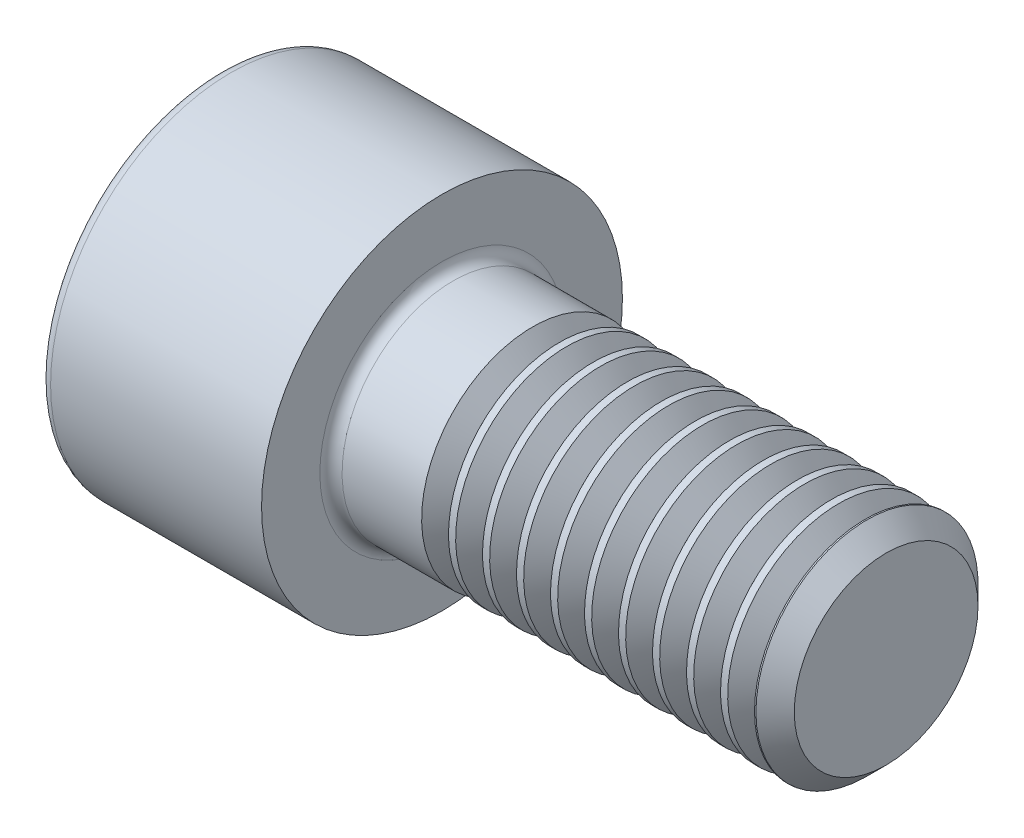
from build123d import *

# Parameters (mm, degrees)
FILLET1_R       = 0.4
FILLET2_R       = 0.4
HEX_2_DEPTH     = 4
THDSCHPAT_COUNT = 10
THDSCHPAT_PITCH = 1.225


with BuildPart() as part:
    # BodySke → Base-Revolve (revolve)
    with BuildSketch(Plane.XY, mode=Mode.PRIVATE) as base_revolve_sk:
        Polygon((0, 0), (0, 6.5), (8, 6.5), (8, 4), (23.3095, 4), (24, 3.3095), (24, 0), align=None)
    revolve(base_revolve_sk.sketch.rotate(Axis((-31.75, 0, 0), (1, 0, 0)), 90), axis=Axis((-31.75, 0, 0), (1, 0, 0)))

    # Fillet1
    fillet1_edges = [part.edges().sort_by_distance(p)[0] for p in [
        (8, 0, -4),
    ]]
    fillet(fillet1_edges, radius=FILLET1_R)

    # Fillet2
    fillet2_edges = [part.edges().sort_by_distance(p)[0] for p in [
        (0, 0, -6.5),
    ]]
    fillet(fillet2_edges, radius=FILLET2_R)

    # Sketch2 → Hex-PreBroach (revolve, cut)
    with BuildSketch(Plane.XY, mode=Mode.PRIVATE) as hex_prebroach_sk:
        Polygon((0, 3.0475), (4, 3.0475), (5.759474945, 0), (0, 0), align=None)
    revolve(hex_prebroach_sk.sketch.rotate(Axis((0, 0, 0), (1, 0, 0)), 90), axis=Axis((0, 0, 0), (1, 0, 0)), mode=Mode.SUBTRACT)

    # Sketch3 → Hex 2 (cut)
    with BuildSketch(Plane(origin=(0, 0, 0), x_dir=(0, 0.500000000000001, 0.866025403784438), z_dir=(-1, 0, 0))):
        Polygon((1.759474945, 3.0475), (-1.759474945, 3.0475), (-3.518949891, 0), (-1.759474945, -3.0475), (1.759474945, -3.0475), (3.518949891, 0), align=None)
    extrude(amount=-HEX_2_DEPTH, mode=Mode.SUBTRACT)

    # ThdSchSke → ThreadSchematic (revolve, cut)
    with BuildSketch(Plane.XY):
        Polygon((11.75, -3.3095), (11.266506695, -4), (11.266506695, -5), (12.233493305, -5), (12.233493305, -4), align=None)
    threadschematic = revolve(axis=Axis((-3.175, 0, 0), (1, 0, 0)), mode=Mode.SUBTRACT)

    # ThdSchPat: ThreadSchematic ×10
    with Locations(*[(i * THDSCHPAT_PITCH, 0, 0) for i in range(1, THDSCHPAT_COUNT)]):
        add(threadschematic, mode=Mode.SUBTRACT)


solid = part.part
